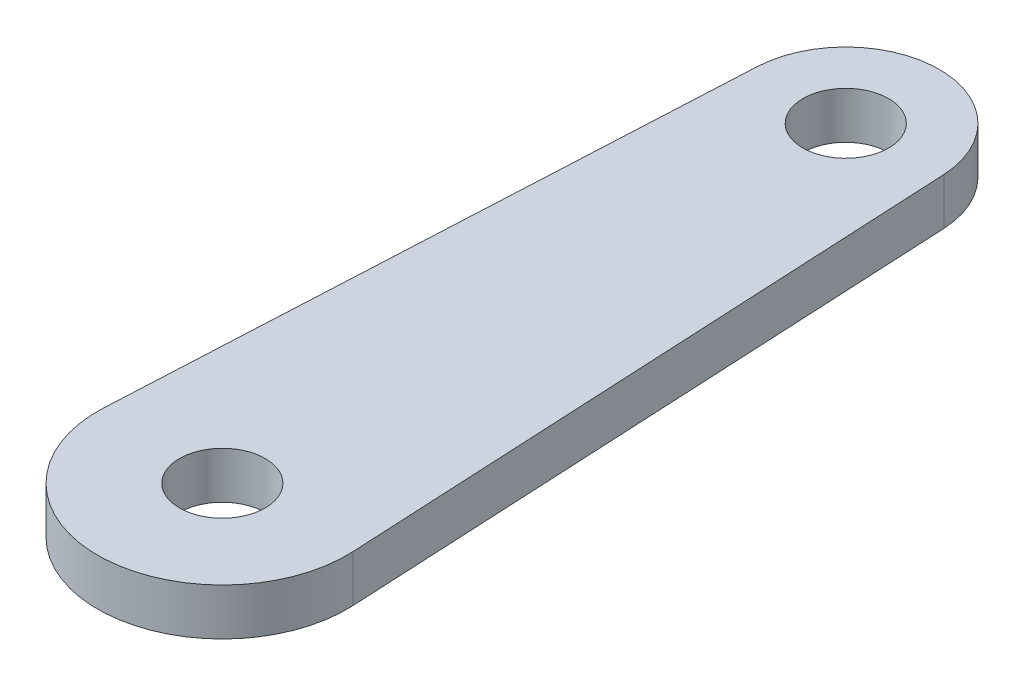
from build123d import *

# Parameters (mm, degrees)
SKETCH1_R      = 2.75
EXTRUDE1_DEPTH = 3


with BuildPart() as part:
    # Sketch1 → Extrude1 (new body)
    with BuildSketch(Plane(origin=(0, 0, 0), x_dir=(1, 0, 0), z_dir=(0, 1, 0))):
        with BuildLine():
            Line((-5.992495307, 40.3), (-7.989993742, 0.4))
            ThreePointArc((-7.989993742, 0.4), (0, -8), (7.989993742, 0.4))
            Line((7.989993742, 0.4), (5.992495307, 40.3))
            ThreePointArc((5.992495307, 40.3), (0, 46), (-5.992495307, 40.3))
        make_face()
        with Locations(Location((0, 0, 0), (0, 0, 270))):
            Circle(SKETCH1_R, mode=Mode.SUBTRACT)
        with Locations(Location((0, 40, 0), (0, 0, 270))):
            Circle(SKETCH1_R, mode=Mode.SUBTRACT)
    extrude(amount=EXTRUDE1_DEPTH)


solid = part.part
